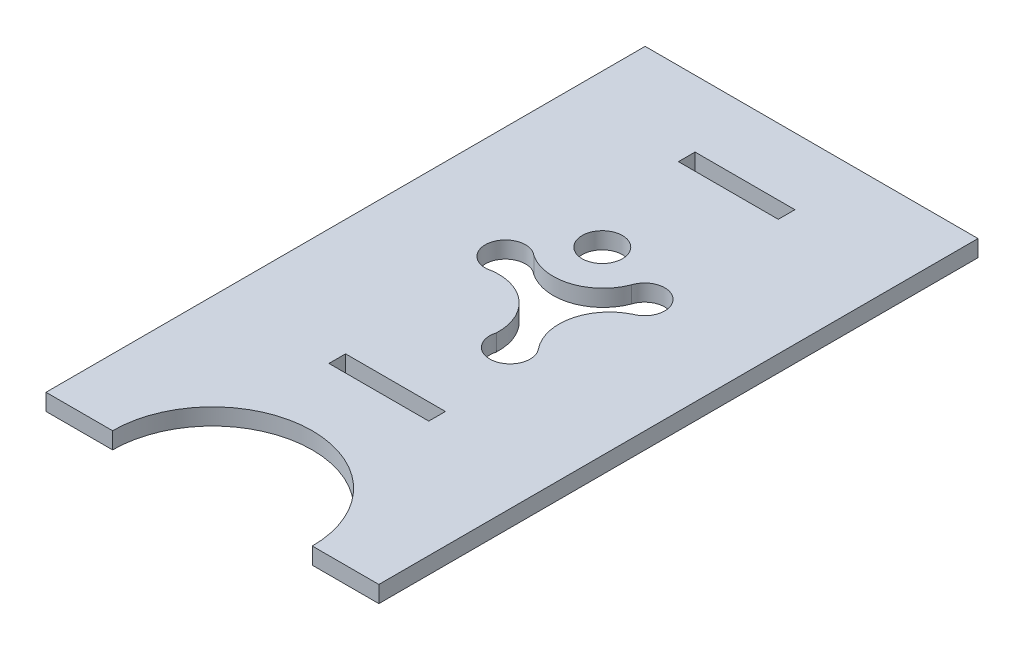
ISO-10303-21;
HEADER;
FILE_DESCRIPTION(('STEP AP214'),'2;1');
FILE_NAME('part.step','',(''),(''),'','','');
FILE_SCHEMA(('AUTOMOTIVE_DESIGN { 1 0 10303 214 1 1 1 1 }'));
ENDSEC;
DATA;
#1=APPLICATION_CONTEXT('core data for automotive mechanical design processes');
#2=APPLICATION_PROTOCOL_DEFINITION('international standard','automotive_design',2000,#1);
#3=PRODUCT_CONTEXT('',#1,'mechanical');
#4=PRODUCT('Part','Part','',(#3));
#5=PRODUCT_RELATED_PRODUCT_CATEGORY('part','',(#4));
#6=PRODUCT_DEFINITION_FORMATION('','',#4);
#7=PRODUCT_DEFINITION_CONTEXT('part definition',#1,'design');
#8=PRODUCT_DEFINITION('design','',#6,#7);
#9=PRODUCT_DEFINITION_SHAPE('','',#8);
#10=(LENGTH_UNIT() NAMED_UNIT(*) SI_UNIT(.MILLI.,.METRE.));
#11=(NAMED_UNIT(*) PLANE_ANGLE_UNIT() SI_UNIT($,.RADIAN.));
#12=(NAMED_UNIT(*) SI_UNIT($,.STERADIAN.) SOLID_ANGLE_UNIT());
#13=UNCERTAINTY_MEASURE_WITH_UNIT(LENGTH_MEASURE(1.E-05),#10,'distance_accuracy_value','');
#14=(GEOMETRIC_REPRESENTATION_CONTEXT(3) GLOBAL_UNCERTAINTY_ASSIGNED_CONTEXT((#13)) GLOBAL_UNIT_ASSIGNED_CONTEXT((#10,
#11,#12)) REPRESENTATION_CONTEXT('',''));
#15=CARTESIAN_POINT('',(0.,0.,0.));
#16=DIRECTION('',(0.,0.,1.));
#17=DIRECTION('',(1.,0.,0.));
#18=AXIS2_PLACEMENT_3D('',#15,#16,#17);
#19=CARTESIAN_POINT('',(320.516384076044,5.,0.));
#20=DIRECTION('',(-1.,0.,0.));
#21=DIRECTION('',(0.,0.,1.));
#22=AXIS2_PLACEMENT_3D('',#19,#20,#21);
#23=PLANE('',#22);
#24=DIRECTION('',(0.,0.,-1.));
#25=VECTOR('',#24,1.);
#26=CARTESIAN_POINT('',(320.516384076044,0.,0.));
#27=LINE('',#26,#25);
#28=CARTESIAN_POINT('',(320.516384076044,0.,-24.0936382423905));
#29=VERTEX_POINT('',#28);
#30=CARTESIAN_POINT('',(320.516384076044,0.,-29.0936382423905));
#31=VERTEX_POINT('',#30);
#32=EDGE_CURVE('E296',#29,#31,#27,.T.);
#33=ORIENTED_EDGE('',*,*,#32,.T.);
#34=DIRECTION('',(0.,-1.,0.));
#35=VECTOR('',#34,1.);
#36=CARTESIAN_POINT('',(320.516384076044,5.,-29.0936382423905));
#37=LINE('',#36,#35);
#38=CARTESIAN_POINT('',(320.516384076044,5.,-29.0936382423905));
#39=VERTEX_POINT('',#38);
#40=EDGE_CURVE('E11',#39,#31,#37,.T.);
#41=ORIENTED_EDGE('',*,*,#40,.F.);
#42=DIRECTION('',(0.,0.,-1.));
#43=VECTOR('',#42,1.);
#44=CARTESIAN_POINT('',(320.516384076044,5.,0.));
#45=LINE('',#44,#43);
#46=CARTESIAN_POINT('',(320.516384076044,5.,-24.0936382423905));
#47=VERTEX_POINT('',#46);
#48=EDGE_CURVE('E258',#47,#39,#45,.T.);
#49=ORIENTED_EDGE('',*,*,#48,.F.);
#50=DIRECTION('',(0.,-1.,0.));
#51=VECTOR('',#50,1.);
#52=CARTESIAN_POINT('',(320.516384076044,5.,-24.0936382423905));
#53=LINE('',#52,#51);
#54=EDGE_CURVE('E304',#47,#29,#53,.T.);
#55=ORIENTED_EDGE('',*,*,#54,.T.);
#56=EDGE_LOOP('',(#33,#41,#49,#55));
#57=FACE_BOUND('',#56,.T.);
#58=ADVANCED_FACE('F34',(#57),#23,.F.);
#59=CARTESIAN_POINT('',(0.,5.,-29.0936382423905));
#60=DIRECTION('',(0.,0.,-1.));
#61=DIRECTION('',(-1.,0.,0.));
#62=AXIS2_PLACEMENT_3D('',#59,#60,#61);
#63=PLANE('',#62);
#64=DIRECTION('',(1.,0.,0.));
#65=VECTOR('',#64,1.);
#66=CARTESIAN_POINT('',(0.,0.,-29.0936382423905));
#67=LINE('',#66,#65);
#68=CARTESIAN_POINT('',(350.516384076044,0.,-29.0936382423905));
#69=VERTEX_POINT('',#68);
#70=EDGE_CURVE('E299',#31,#69,#67,.T.);
#71=ORIENTED_EDGE('',*,*,#70,.T.);
#72=DIRECTION('',(0.,-1.,0.));
#73=VECTOR('',#72,1.);
#74=CARTESIAN_POINT('',(350.516384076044,5.,-29.0936382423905));
#75=LINE('',#74,#73);
#76=CARTESIAN_POINT('',(350.516384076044,5.,-29.0936382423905));
#77=VERTEX_POINT('',#76);
#78=EDGE_CURVE('E43',#77,#69,#75,.T.);
#79=ORIENTED_EDGE('',*,*,#78,.F.);
#80=DIRECTION('',(1.,0.,0.));
#81=VECTOR('',#80,1.);
#82=CARTESIAN_POINT('',(0.,5.,-29.0936382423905));
#83=LINE('',#82,#81);
#84=EDGE_CURVE('E261',#39,#77,#83,.T.);
#85=ORIENTED_EDGE('',*,*,#84,.F.);
#86=ORIENTED_EDGE('',*,*,#40,.T.);
#87=EDGE_LOOP('',(#71,#79,#85,#86));
#88=FACE_BOUND('',#87,.T.);
#89=ADVANCED_FACE('F363',(#88),#63,.F.);
#90=CARTESIAN_POINT('',(350.516384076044,5.,0.));
#91=DIRECTION('',(1.,0.,0.));
#92=DIRECTION('',(0.,0.,-1.));
#93=AXIS2_PLACEMENT_3D('',#90,#91,#92);
#94=PLANE('',#93);
#95=DIRECTION('',(0.,0.,1.));
#96=VECTOR('',#95,1.);
#97=CARTESIAN_POINT('',(350.516384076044,0.,0.));
#98=LINE('',#97,#96);
#99=CARTESIAN_POINT('',(350.516384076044,0.,-24.0936382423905));
#100=VERTEX_POINT('',#99);
#101=EDGE_CURVE('E301',#69,#100,#98,.T.);
#102=ORIENTED_EDGE('',*,*,#101,.T.);
#103=DIRECTION('',(0.,-1.,0.));
#104=VECTOR('',#103,1.);
#105=CARTESIAN_POINT('',(350.516384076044,5.,-24.0936382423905));
#106=LINE('',#105,#104);
#107=CARTESIAN_POINT('',(350.516384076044,5.,-24.0936382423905));
#108=VERTEX_POINT('',#107);
#109=EDGE_CURVE('E307',#108,#100,#106,.T.);
#110=ORIENTED_EDGE('',*,*,#109,.F.);
#111=DIRECTION('',(0.,0.,1.));
#112=VECTOR('',#111,1.);
#113=CARTESIAN_POINT('',(350.516384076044,5.,0.));
#114=LINE('',#113,#112);
#115=EDGE_CURVE('E263',#77,#108,#114,.T.);
#116=ORIENTED_EDGE('',*,*,#115,.F.);
#117=ORIENTED_EDGE('',*,*,#78,.T.);
#118=EDGE_LOOP('',(#102,#110,#116,#117));
#119=FACE_BOUND('',#118,.T.);
#120=ADVANCED_FACE('F369',(#119),#94,.F.);
#121=CARTESIAN_POINT('',(320.516384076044,5.,0.));
#122=DIRECTION('',(1.,0.,0.));
#123=DIRECTION('',(0.,0.,-1.));
#124=AXIS2_PLACEMENT_3D('',#121,#122,#123);
#125=PLANE('',#124);
#126=DIRECTION('',(0.,0.,1.));
#127=VECTOR('',#126,1.);
#128=CARTESIAN_POINT('',(320.516384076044,0.,0.));
#129=LINE('',#128,#127);
#130=CARTESIAN_POINT('',(320.516384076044,0.,75.9063617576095));
#131=VERTEX_POINT('',#130);
#132=CARTESIAN_POINT('',(320.516384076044,0.,80.9063617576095));
#133=VERTEX_POINT('',#132);
#134=EDGE_CURVE('E284',#131,#133,#129,.T.);
#135=ORIENTED_EDGE('',*,*,#134,.F.);
#136=DIRECTION('',(0.,-1.,0.));
#137=VECTOR('',#136,1.);
#138=CARTESIAN_POINT('',(320.516384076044,5.,75.9063617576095));
#139=LINE('',#138,#137);
#140=CARTESIAN_POINT('',(320.516384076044,5.,75.9063617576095));
#141=VERTEX_POINT('',#140);
#142=EDGE_CURVE('E308',#141,#131,#139,.T.);
#143=ORIENTED_EDGE('',*,*,#142,.F.);
#144=DIRECTION('',(0.,0.,1.));
#145=VECTOR('',#144,1.);
#146=CARTESIAN_POINT('',(320.516384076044,5.,0.));
#147=LINE('',#146,#145);
#148=CARTESIAN_POINT('',(320.516384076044,5.,80.9063617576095));
#149=VERTEX_POINT('',#148);
#150=EDGE_CURVE('E246',#141,#149,#147,.T.);
#151=ORIENTED_EDGE('',*,*,#150,.T.);
#152=DIRECTION('',(0.,-1.,0.));
#153=VECTOR('',#152,1.);
#154=CARTESIAN_POINT('',(320.516384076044,5.,80.9063617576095));
#155=LINE('',#154,#153);
#156=EDGE_CURVE('E313',#149,#133,#155,.T.);
#157=ORIENTED_EDGE('',*,*,#156,.T.);
#158=EDGE_LOOP('',(#135,#143,#151,#157));
#159=FACE_BOUND('',#158,.T.);
#160=ADVANCED_FACE('F385',(#159),#125,.T.);
#161=CARTESIAN_POINT('',(0.,5.,75.9063617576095));
#162=DIRECTION('',(0.,0.,1.));
#163=DIRECTION('',(1.,0.,0.));
#164=AXIS2_PLACEMENT_3D('',#161,#162,#163);
#165=PLANE('',#164);
#166=DIRECTION('',(-1.,0.,0.));
#167=VECTOR('',#166,1.);
#168=CARTESIAN_POINT('',(0.,0.,75.9063617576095));
#169=LINE('',#168,#167);
#170=CARTESIAN_POINT('',(350.516384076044,0.,75.9063617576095));
#171=VERTEX_POINT('',#170);
#172=EDGE_CURVE('E287',#171,#131,#169,.T.);
#173=ORIENTED_EDGE('',*,*,#172,.F.);
#174=DIRECTION('',(0.,-1.,0.));
#175=VECTOR('',#174,1.);
#176=CARTESIAN_POINT('',(350.516384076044,5.,75.9063617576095));
#177=LINE('',#176,#175);
#178=CARTESIAN_POINT('',(350.516384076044,5.,75.9063617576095));
#179=VERTEX_POINT('',#178);
#180=EDGE_CURVE('E317',#179,#171,#177,.T.);
#181=ORIENTED_EDGE('',*,*,#180,.F.);
#182=DIRECTION('',(-1.,0.,0.));
#183=VECTOR('',#182,1.);
#184=CARTESIAN_POINT('',(0.,5.,75.9063617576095));
#185=LINE('',#184,#183);
#186=EDGE_CURVE('E249',#179,#141,#185,.T.);
#187=ORIENTED_EDGE('',*,*,#186,.T.);
#188=ORIENTED_EDGE('',*,*,#142,.T.);
#189=EDGE_LOOP('',(#173,#181,#187,#188));
#190=FACE_BOUND('',#189,.T.);
#191=ADVANCED_FACE('F381',(#190),#165,.T.);
#192=CARTESIAN_POINT('',(350.516384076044,5.,0.));
#193=DIRECTION('',(-1.,0.,0.));
#194=DIRECTION('',(0.,0.,1.));
#195=AXIS2_PLACEMENT_3D('',#192,#193,#194);
#196=PLANE('',#195);
#197=DIRECTION('',(0.,0.,-1.));
#198=VECTOR('',#197,1.);
#199=CARTESIAN_POINT('',(350.516384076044,0.,0.));
#200=LINE('',#199,#198);
#201=CARTESIAN_POINT('',(350.516384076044,0.,80.9063617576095));
#202=VERTEX_POINT('',#201);
#203=EDGE_CURVE('E290',#202,#171,#200,.T.);
#204=ORIENTED_EDGE('',*,*,#203,.F.);
#205=DIRECTION('',(0.,-1.,0.));
#206=VECTOR('',#205,1.);
#207=CARTESIAN_POINT('',(350.516384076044,5.,80.9063617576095));
#208=LINE('',#207,#206);
#209=CARTESIAN_POINT('',(350.516384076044,5.,80.9063617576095));
#210=VERTEX_POINT('',#209);
#211=EDGE_CURVE('E315',#210,#202,#208,.T.);
#212=ORIENTED_EDGE('',*,*,#211,.F.);
#213=DIRECTION('',(0.,0.,-1.));
#214=VECTOR('',#213,1.);
#215=CARTESIAN_POINT('',(350.516384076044,5.,0.));
#216=LINE('',#215,#214);
#217=EDGE_CURVE('E252',#210,#179,#216,.T.);
#218=ORIENTED_EDGE('',*,*,#217,.T.);
#219=ORIENTED_EDGE('',*,*,#180,.T.);
#220=EDGE_LOOP('',(#204,#212,#218,#219));
#221=FACE_BOUND('',#220,.T.);
#222=ADVANCED_FACE('F378',(#221),#196,.T.);
#223=CARTESIAN_POINT('',(335.516384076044,5.,130.90636175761));
#224=DIRECTION('',(0.,-1.,0.));
#225=DIRECTION('',(0.,0.,-1.));
#226=AXIS2_PLACEMENT_3D('',#223,#224,#225);
#227=CYLINDRICAL_SURFACE('',#226,30.);
#228=CARTESIAN_POINT('',(335.516384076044,0.,130.90636175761));
#229=DIRECTION('',(0.,1.,0.));
#230=DIRECTION('',(0.,0.,1.));
#231=AXIS2_PLACEMENT_3D('',#228,#229,#230);
#232=CIRCLE('',#231,30.);
#233=CARTESIAN_POINT('',(365.516384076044,0.,130.90636175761));
#234=VERTEX_POINT('',#233);
#235=CARTESIAN_POINT('',(305.516384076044,0.,130.90636175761));
#236=VERTEX_POINT('',#235);
#237=EDGE_CURVE('E222',#234,#236,#232,.T.);
#238=ORIENTED_EDGE('',*,*,#237,.F.);
#239=DIRECTION('',(0.,-1.,0.));
#240=VECTOR('',#239,1.);
#241=CARTESIAN_POINT('',(365.516384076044,5.,130.90636175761));
#242=LINE('',#241,#240);
#243=CARTESIAN_POINT('',(365.516384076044,5.,130.90636175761));
#244=VERTEX_POINT('',#243);
#245=EDGE_CURVE('E38',#244,#234,#242,.T.);
#246=ORIENTED_EDGE('',*,*,#245,.F.);
#247=CARTESIAN_POINT('',(335.516384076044,5.,130.90636175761));
#248=DIRECTION('',(0.,1.,0.));
#249=DIRECTION('',(0.,0.,1.));
#250=AXIS2_PLACEMENT_3D('',#247,#248,#249);
#251=CIRCLE('',#250,30.);
#252=CARTESIAN_POINT('',(305.516384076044,5.,130.90636175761));
#253=VERTEX_POINT('',#252);
#254=EDGE_CURVE('E230',#244,#253,#251,.T.);
#255=ORIENTED_EDGE('',*,*,#254,.T.);
#256=DIRECTION('',(0.,-1.,0.));
#257=VECTOR('',#256,1.);
#258=CARTESIAN_POINT('',(305.516384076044,5.,130.90636175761));
#259=LINE('',#258,#257);
#260=EDGE_CURVE('E267',#253,#236,#259,.T.);
#261=ORIENTED_EDGE('',*,*,#260,.T.);
#262=EDGE_LOOP('',(#238,#246,#255,#261));
#263=FACE_BOUND('',#262,.T.);
#264=ADVANCED_FACE('F36',(#263),#227,.F.);
#265=CARTESIAN_POINT('',(0.,5.,130.90636175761));
#266=DIRECTION('',(0.,0.,-1.));
#267=DIRECTION('',(-1.,0.,0.));
#268=AXIS2_PLACEMENT_3D('',#265,#266,#267);
#269=PLANE('',#268);
#270=DIRECTION('',(1.,0.,0.));
#271=VECTOR('',#270,1.);
#272=CARTESIAN_POINT('',(0.,0.,130.90636175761));
#273=LINE('',#272,#271);
#274=CARTESIAN_POINT('',(385.516384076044,0.,130.90636175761));
#275=VERTEX_POINT('',#274);
#276=EDGE_CURVE('E270',#234,#275,#273,.T.);
#277=ORIENTED_EDGE('',*,*,#276,.T.);
#278=DIRECTION('',(0.,-1.,0.));
#279=VECTOR('',#278,1.);
#280=CARTESIAN_POINT('',(385.516384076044,5.,130.90636175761));
#281=LINE('',#280,#279);
#282=CARTESIAN_POINT('',(385.516384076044,5.,130.90636175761));
#283=VERTEX_POINT('',#282);
#284=EDGE_CURVE('E326',#283,#275,#281,.T.);
#285=ORIENTED_EDGE('',*,*,#284,.F.);
#286=DIRECTION('',(1.,0.,0.));
#287=VECTOR('',#286,1.);
#288=CARTESIAN_POINT('',(0.,5.,130.90636175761));
#289=LINE('',#288,#287);
#290=EDGE_CURVE('E233',#244,#283,#289,.T.);
#291=ORIENTED_EDGE('',*,*,#290,.F.);
#292=ORIENTED_EDGE('',*,*,#245,.T.);
#293=EDGE_LOOP('',(#277,#285,#291,#292));
#294=FACE_BOUND('',#293,.T.);
#295=ADVANCED_FACE('F335',(#294),#269,.F.);
#296=CARTESIAN_POINT('',(385.516384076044,5.,0.));
#297=DIRECTION('',(-1.,0.,0.));
#298=DIRECTION('',(0.,0.,1.));
#299=AXIS2_PLACEMENT_3D('',#296,#297,#298);
#300=PLANE('',#299);
#301=DIRECTION('',(0.,0.,-1.));
#302=VECTOR('',#301,1.);
#303=CARTESIAN_POINT('',(385.516384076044,0.,0.));
#304=LINE('',#303,#302);
#305=CARTESIAN_POINT('',(385.516384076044,0.,-49.0936382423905));
#306=VERTEX_POINT('',#305);
#307=EDGE_CURVE('E272',#275,#306,#304,.T.);
#308=ORIENTED_EDGE('',*,*,#307,.T.);
#309=DIRECTION('',(0.,-1.,0.));
#310=VECTOR('',#309,1.);
#311=CARTESIAN_POINT('',(385.516384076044,5.,-49.0936382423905));
#312=LINE('',#311,#310);
#313=CARTESIAN_POINT('',(385.516384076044,5.,-49.0936382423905));
#314=VERTEX_POINT('',#313);
#315=EDGE_CURVE('E325',#314,#306,#312,.T.);
#316=ORIENTED_EDGE('',*,*,#315,.F.);
#317=DIRECTION('',(0.,0.,-1.));
#318=VECTOR('',#317,1.);
#319=CARTESIAN_POINT('',(385.516384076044,5.,0.));
#320=LINE('',#319,#318);
#321=EDGE_CURVE('E236',#283,#314,#320,.T.);
#322=ORIENTED_EDGE('',*,*,#321,.F.);
#323=ORIENTED_EDGE('',*,*,#284,.T.);
#324=EDGE_LOOP('',(#308,#316,#322,#323));
#325=FACE_BOUND('',#324,.T.);
#326=ADVANCED_FACE('F354',(#325),#300,.F.);
#327=CARTESIAN_POINT('',(0.,5.,-49.0936382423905));
#328=DIRECTION('',(0.,0.,-1.));
#329=DIRECTION('',(-1.,0.,0.));
#330=AXIS2_PLACEMENT_3D('',#327,#328,#329);
#331=PLANE('',#330);
#332=DIRECTION('',(1.,0.,0.));
#333=VECTOR('',#332,1.);
#334=CARTESIAN_POINT('',(0.,0.,-49.0936382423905));
#335=LINE('',#334,#333);
#336=CARTESIAN_POINT('',(285.516384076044,0.,-49.0936382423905));
#337=VERTEX_POINT('',#336);
#338=EDGE_CURVE('E275',#337,#306,#335,.T.);
#339=ORIENTED_EDGE('',*,*,#338,.F.);
#340=DIRECTION('',(0.,-1.,0.));
#341=VECTOR('',#340,1.);
#342=CARTESIAN_POINT('',(285.516384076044,5.,-49.0936382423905));
#343=LINE('',#342,#341);
#344=CARTESIAN_POINT('',(285.516384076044,5.,-49.0936382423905));
#345=VERTEX_POINT('',#344);
#346=EDGE_CURVE('E323',#345,#337,#343,.T.);
#347=ORIENTED_EDGE('',*,*,#346,.F.);
#348=DIRECTION('',(1.,0.,0.));
#349=VECTOR('',#348,1.);
#350=CARTESIAN_POINT('',(0.,5.,-49.0936382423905));
#351=LINE('',#350,#349);
#352=EDGE_CURVE('E238',#345,#314,#351,.T.);
#353=ORIENTED_EDGE('',*,*,#352,.T.);
#354=ORIENTED_EDGE('',*,*,#315,.T.);
#355=EDGE_LOOP('',(#339,#347,#353,#354));
#356=FACE_BOUND('',#355,.T.);
#357=ADVANCED_FACE('F352',(#356),#331,.T.);
#358=CARTESIAN_POINT('',(285.516384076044,5.,0.));
#359=DIRECTION('',(-1.,0.,0.));
#360=DIRECTION('',(0.,0.,1.));
#361=AXIS2_PLACEMENT_3D('',#358,#359,#360);
#362=PLANE('',#361);
#363=DIRECTION('',(0.,0.,-1.));
#364=VECTOR('',#363,1.);
#365=CARTESIAN_POINT('',(285.516384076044,0.,0.));
#366=LINE('',#365,#364);
#367=CARTESIAN_POINT('',(285.516384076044,0.,130.90636175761));
#368=VERTEX_POINT('',#367);
#369=EDGE_CURVE('E278',#368,#337,#366,.T.);
#370=ORIENTED_EDGE('',*,*,#369,.F.);
#371=DIRECTION('',(0.,-1.,0.));
#372=VECTOR('',#371,1.);
#373=CARTESIAN_POINT('',(285.516384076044,5.,130.90636175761));
#374=LINE('',#373,#372);
#375=CARTESIAN_POINT('',(285.516384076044,5.,130.90636175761));
#376=VERTEX_POINT('',#375);
#377=EDGE_CURVE('E321',#376,#368,#374,.T.);
#378=ORIENTED_EDGE('',*,*,#377,.F.);
#379=DIRECTION('',(0.,0.,-1.));
#380=VECTOR('',#379,1.);
#381=CARTESIAN_POINT('',(285.516384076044,5.,0.));
#382=LINE('',#381,#380);
#383=EDGE_CURVE('E241',#376,#345,#382,.T.);
#384=ORIENTED_EDGE('',*,*,#383,.T.);
#385=ORIENTED_EDGE('',*,*,#346,.T.);
#386=EDGE_LOOP('',(#370,#378,#384,#385));
#387=FACE_BOUND('',#386,.T.);
#388=ADVANCED_FACE('F347',(#387),#362,.T.);
#389=CARTESIAN_POINT('',(0.,5.,80.9063617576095));
#390=DIRECTION('',(0.,0.,-1.));
#391=DIRECTION('',(-1.,0.,0.));
#392=AXIS2_PLACEMENT_3D('',#389,#390,#391);
#393=PLANE('',#392);
#394=DIRECTION('',(1.,0.,0.));
#395=VECTOR('',#394,1.);
#396=CARTESIAN_POINT('',(0.,0.,80.9063617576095));
#397=LINE('',#396,#395);
#398=EDGE_CURVE('E293',#133,#202,#397,.T.);
#399=ORIENTED_EDGE('',*,*,#398,.F.);
#400=ORIENTED_EDGE('',*,*,#156,.F.);
#401=DIRECTION('',(1.,0.,0.));
#402=VECTOR('',#401,1.);
#403=CARTESIAN_POINT('',(0.,5.,80.9063617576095));
#404=LINE('',#403,#402);
#405=EDGE_CURVE('E255',#149,#210,#404,.T.);
#406=ORIENTED_EDGE('',*,*,#405,.T.);
#407=ORIENTED_EDGE('',*,*,#211,.T.);
#408=EDGE_LOOP('',(#399,#400,#406,#407));
#409=FACE_BOUND('',#408,.T.);
#410=ADVANCED_FACE('F374',(#409),#393,.T.);
#411=CARTESIAN_POINT('',(0.,5.,130.90636175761));
#412=DIRECTION('',(0.,0.,-1.));
#413=DIRECTION('',(-1.,0.,0.));
#414=AXIS2_PLACEMENT_3D('',#411,#412,#413);
#415=PLANE('',#414);
#416=DIRECTION('',(1.,0.,0.));
#417=VECTOR('',#416,1.);
#418=CARTESIAN_POINT('',(0.,0.,130.90636175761));
#419=LINE('',#418,#417);
#420=EDGE_CURVE('E281',#368,#236,#419,.T.);
#421=ORIENTED_EDGE('',*,*,#420,.T.);
#422=ORIENTED_EDGE('',*,*,#260,.F.);
#423=DIRECTION('',(1.,0.,0.));
#424=VECTOR('',#423,1.);
#425=CARTESIAN_POINT('',(0.,5.,130.90636175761));
#426=LINE('',#425,#424);
#427=EDGE_CURVE('E244',#376,#253,#426,.T.);
#428=ORIENTED_EDGE('',*,*,#427,.F.);
#429=ORIENTED_EDGE('',*,*,#377,.T.);
#430=EDGE_LOOP('',(#421,#422,#428,#429));
#431=FACE_BOUND('',#430,.T.);
#432=ADVANCED_FACE('F344',(#431),#415,.F.);
#433=CARTESIAN_POINT('',(0.,5.,-24.0936382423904));
#434=DIRECTION('',(0.,0.,1.));
#435=DIRECTION('',(1.,0.,0.));
#436=AXIS2_PLACEMENT_3D('',#433,#434,#435);
#437=PLANE('',#436);
#438=DIRECTION('',(-1.,0.,0.));
#439=VECTOR('',#438,1.);
#440=CARTESIAN_POINT('',(0.,0.,-24.0936382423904));
#441=LINE('',#440,#439);
#442=EDGE_CURVE('E234',#100,#29,#441,.T.);
#443=ORIENTED_EDGE('',*,*,#442,.T.);
#444=ORIENTED_EDGE('',*,*,#54,.F.);
#445=DIRECTION('',(-1.,0.,0.));
#446=VECTOR('',#445,1.);
#447=CARTESIAN_POINT('',(0.,5.,-24.0936382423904));
#448=LINE('',#447,#446);
#449=EDGE_CURVE('E265',#108,#47,#448,.T.);
#450=ORIENTED_EDGE('',*,*,#449,.F.);
#451=ORIENTED_EDGE('',*,*,#109,.T.);
#452=EDGE_LOOP('',(#443,#444,#450,#451));
#453=FACE_BOUND('',#452,.T.);
#454=ADVANCED_FACE('F392',(#453),#437,.F.);
#455=CARTESIAN_POINT('',(0.,5.,0.));
#456=DIRECTION('',(0.,1.,0.));
#457=DIRECTION('',(0.,0.,1.));
#458=AXIS2_PLACEMENT_3D('',#455,#456,#457);
#459=PLANE('',#458);
#460=CARTESIAN_POINT('',(331.312352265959,5.,9.57710534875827));
#461=DIRECTION('',(0.,1.,0.));
#462=DIRECTION('',(0.,0.,1.));
#463=AXIS2_PLACEMENT_3D('',#460,#461,#462);
#464=CIRCLE('',#463,6.05062381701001);
#465=CARTESIAN_POINT('',(331.312352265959,5.,15.6277291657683));
#466=VERTEX_POINT('',#465);
#467=EDGE_CURVE('E198',#466,#466,#464,.T.);
#468=ORIENTED_EDGE('',*,*,#467,.F.);
#469=EDGE_LOOP('',(#468));
#470=FACE_BOUND('',#469,.T.);
#471=CARTESIAN_POINT('',(359.997267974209,5.,36.1050249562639));
#472=DIRECTION('',(0.,-1.,0.));
#473=DIRECTION('',(0.,0.,1.));
#474=AXIS2_PLACEMENT_3D('',#471,#472,#473);
#475=CIRCLE('',#474,15.1697355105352);
#476=CARTESIAN_POINT('',(348.187897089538,5.,45.6265602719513));
#477=VERTEX_POINT('',#476);
#478=CARTESIAN_POINT('',(353.340812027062,5.,22.4737201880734));
#479=VERTEX_POINT('',#478);
#480=EDGE_CURVE('E51',#477,#479,#475,.T.);
#481=ORIENTED_EDGE('',*,*,#480,.F.);
#482=CARTESIAN_POINT('',(343.533575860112,5.,49.5317243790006));
#483=DIRECTION('',(0.,1.,0.));
#484=DIRECTION('',(0.,0.,1.));
#485=AXIS2_PLACEMENT_3D('',#482,#483,#484);
#486=CIRCLE('',#485,6.07560801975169);
#487=CARTESIAN_POINT('',(337.704600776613,5.,47.8182302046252));
#488=VERTEX_POINT('',#487);
#489=EDGE_CURVE('E192',#488,#477,#486,.T.);
#490=ORIENTED_EDGE('',*,*,#489,.F.);
#491=CARTESIAN_POINT('',(322.786208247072,5.,47.1331914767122));
#492=DIRECTION('',(0.,-1.,0.));
#493=DIRECTION('',(0.,0.,-1.));
#494=AXIS2_PLACEMENT_3D('',#491,#492,#493);
#495=CIRCLE('',#494,14.9341124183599);
#496=CARTESIAN_POINT('',(320.977861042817,5.,32.3089682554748));
#497=VERTEX_POINT('',#496);
#498=EDGE_CURVE('E195',#497,#488,#495,.T.);
#499=ORIENTED_EDGE('',*,*,#498,.F.);
#500=CARTESIAN_POINT('',(319.163390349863,5.,26.5394534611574));
#501=DIRECTION('',(0.,1.,0.));
#502=DIRECTION('',(0.,0.,1.));
#503=AXIS2_PLACEMENT_3D('',#500,#501,#502);
#504=CIRCLE('',#503,6.04810754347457);
#505=CARTESIAN_POINT('',(323.150194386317,5.,21.991377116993));
#506=VERTEX_POINT('',#505);
#507=EDGE_CURVE('E215',#506,#497,#504,.T.);
#508=ORIENTED_EDGE('',*,*,#507,.F.);
#509=CARTESIAN_POINT('',(331.540936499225,5.,9.57890404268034));
#510=DIRECTION('',(0.,-1.,0.));
#511=DIRECTION('',(0.,0.,1.));
#512=AXIS2_PLACEMENT_3D('',#509,#510,#511);
#513=CIRCLE('',#512,14.9824577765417);
#514=CARTESIAN_POINT('',(345.492976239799,5.,15.0391813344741));
#515=VERTEX_POINT('',#514);
#516=EDGE_CURVE('E212',#515,#506,#513,.T.);
#517=ORIENTED_EDGE('',*,*,#516,.F.);
#518=CARTESIAN_POINT('',(351.263265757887,5.,16.8074366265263));
#519=DIRECTION('',(0.,1.,0.));
#520=DIRECTION('',(0.,0.,1.));
#521=AXIS2_PLACEMENT_3D('',#518,#519,#520);
#522=CIRCLE('',#521,6.0351443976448);
#523=EDGE_CURVE('E209',#479,#515,#522,.T.);
#524=ORIENTED_EDGE('',*,*,#523,.F.);
#525=EDGE_LOOP('',(#481,#490,#499,#508,#517,#524));
#526=FACE_BOUND('',#525,.T.);
#527=ORIENTED_EDGE('',*,*,#254,.F.);
#528=ORIENTED_EDGE('',*,*,#290,.T.);
#529=ORIENTED_EDGE('',*,*,#321,.T.);
#530=ORIENTED_EDGE('',*,*,#352,.F.);
#531=ORIENTED_EDGE('',*,*,#383,.F.);
#532=ORIENTED_EDGE('',*,*,#427,.T.);
#533=EDGE_LOOP('',(#527,#528,#529,#530,#531,#532));
#534=FACE_BOUND('',#533,.T.);
#535=ORIENTED_EDGE('',*,*,#150,.F.);
#536=ORIENTED_EDGE('',*,*,#186,.F.);
#537=ORIENTED_EDGE('',*,*,#217,.F.);
#538=ORIENTED_EDGE('',*,*,#405,.F.);
#539=EDGE_LOOP('',(#535,#536,#537,#538));
#540=FACE_BOUND('',#539,.T.);
#541=ORIENTED_EDGE('',*,*,#48,.T.);
#542=ORIENTED_EDGE('',*,*,#84,.T.);
#543=ORIENTED_EDGE('',*,*,#115,.T.);
#544=ORIENTED_EDGE('',*,*,#449,.T.);
#545=EDGE_LOOP('',(#541,#542,#543,#544));
#546=FACE_BOUND('',#545,.T.);
#547=ADVANCED_FACE('F412',(#470,#526,#534,#540,#546),#459,.T.);
#548=CARTESIAN_POINT('',(0.,0.,0.));
#549=DIRECTION('',(0.,1.,0.));
#550=DIRECTION('',(0.,0.,1.));
#551=AXIS2_PLACEMENT_3D('',#548,#549,#550);
#552=PLANE('',#551);
#553=CARTESIAN_POINT('',(331.312352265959,0.,9.57710534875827));
#554=DIRECTION('',(0.,1.,0.));
#555=DIRECTION('',(0.,0.,1.));
#556=AXIS2_PLACEMENT_3D('',#553,#554,#555);
#557=CIRCLE('',#556,6.05062381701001);
#558=CARTESIAN_POINT('',(331.312352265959,0.,15.6277291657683));
#559=VERTEX_POINT('',#558);
#560=EDGE_CURVE('E210',#559,#559,#557,.T.);
#561=ORIENTED_EDGE('',*,*,#560,.T.);
#562=EDGE_LOOP('',(#561));
#563=FACE_BOUND('',#562,.T.);
#564=CARTESIAN_POINT('',(343.533575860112,0.,49.5317243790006));
#565=DIRECTION('',(0.,1.,0.));
#566=DIRECTION('',(0.,0.,1.));
#567=AXIS2_PLACEMENT_3D('',#564,#565,#566);
#568=CIRCLE('',#567,6.07560801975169);
#569=CARTESIAN_POINT('',(337.704600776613,0.,47.8182302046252));
#570=VERTEX_POINT('',#569);
#571=CARTESIAN_POINT('',(348.187897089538,0.,45.6265602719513));
#572=VERTEX_POINT('',#571);
#573=EDGE_CURVE('E181',#570,#572,#568,.T.);
#574=ORIENTED_EDGE('',*,*,#573,.T.);
#575=CARTESIAN_POINT('',(359.997267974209,0.,36.1050249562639));
#576=DIRECTION('',(0.,-1.,0.));
#577=DIRECTION('',(0.,0.,1.));
#578=AXIS2_PLACEMENT_3D('',#575,#576,#577);
#579=CIRCLE('',#578,15.1697355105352);
#580=CARTESIAN_POINT('',(353.340812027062,0.,22.4737201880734));
#581=VERTEX_POINT('',#580);
#582=EDGE_CURVE('E175',#572,#581,#579,.T.);
#583=ORIENTED_EDGE('',*,*,#582,.T.);
#584=CARTESIAN_POINT('',(351.263265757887,0.,16.8074366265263));
#585=DIRECTION('',(0.,1.,0.));
#586=DIRECTION('',(0.,0.,1.));
#587=AXIS2_PLACEMENT_3D('',#584,#585,#586);
#588=CIRCLE('',#587,6.0351443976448);
#589=CARTESIAN_POINT('',(345.492976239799,0.,15.039181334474));
#590=VERTEX_POINT('',#589);
#591=EDGE_CURVE('E184',#581,#590,#588,.T.);
#592=ORIENTED_EDGE('',*,*,#591,.T.);
#593=CARTESIAN_POINT('',(331.540936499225,0.,9.57890404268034));
#594=DIRECTION('',(0.,-1.,0.));
#595=DIRECTION('',(0.,0.,1.));
#596=AXIS2_PLACEMENT_3D('',#593,#594,#595);
#597=CIRCLE('',#596,14.9824577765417);
#598=CARTESIAN_POINT('',(323.150194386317,0.,21.991377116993));
#599=VERTEX_POINT('',#598);
#600=EDGE_CURVE('E59',#590,#599,#597,.T.);
#601=ORIENTED_EDGE('',*,*,#600,.T.);
#602=CARTESIAN_POINT('',(319.163390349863,0.,26.5394534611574));
#603=DIRECTION('',(0.,1.,0.));
#604=DIRECTION('',(0.,0.,1.));
#605=AXIS2_PLACEMENT_3D('',#602,#603,#604);
#606=CIRCLE('',#605,6.04810754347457);
#607=CARTESIAN_POINT('',(320.977861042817,0.,32.3089682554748));
#608=VERTEX_POINT('',#607);
#609=EDGE_CURVE('E202',#599,#608,#606,.T.);
#610=ORIENTED_EDGE('',*,*,#609,.T.);
#611=CARTESIAN_POINT('',(322.786208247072,0.,47.1331914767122));
#612=DIRECTION('',(0.,-1.,0.));
#613=DIRECTION('',(0.,0.,-1.));
#614=AXIS2_PLACEMENT_3D('',#611,#612,#613);
#615=CIRCLE('',#614,14.9341124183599);
#616=EDGE_CURVE('E205',#608,#570,#615,.T.);
#617=ORIENTED_EDGE('',*,*,#616,.T.);
#618=EDGE_LOOP('',(#574,#583,#592,#601,#610,#617));
#619=FACE_BOUND('',#618,.T.);
#620=ORIENTED_EDGE('',*,*,#237,.T.);
#621=ORIENTED_EDGE('',*,*,#420,.F.);
#622=ORIENTED_EDGE('',*,*,#369,.T.);
#623=ORIENTED_EDGE('',*,*,#338,.T.);
#624=ORIENTED_EDGE('',*,*,#307,.F.);
#625=ORIENTED_EDGE('',*,*,#276,.F.);
#626=EDGE_LOOP('',(#620,#621,#622,#623,#624,#625));
#627=FACE_BOUND('',#626,.T.);
#628=ORIENTED_EDGE('',*,*,#134,.T.);
#629=ORIENTED_EDGE('',*,*,#398,.T.);
#630=ORIENTED_EDGE('',*,*,#203,.T.);
#631=ORIENTED_EDGE('',*,*,#172,.T.);
#632=EDGE_LOOP('',(#628,#629,#630,#631));
#633=FACE_BOUND('',#632,.T.);
#634=ORIENTED_EDGE('',*,*,#32,.F.);
#635=ORIENTED_EDGE('',*,*,#442,.F.);
#636=ORIENTED_EDGE('',*,*,#101,.F.);
#637=ORIENTED_EDGE('',*,*,#70,.F.);
#638=EDGE_LOOP('',(#634,#635,#636,#637));
#639=FACE_BOUND('',#638,.T.);
#640=ADVANCED_FACE('F188',(#563,#619,#627,#633,#639),#552,.F.);
#641=CARTESIAN_POINT('',(359.997267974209,0.,36.1050249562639));
#642=DIRECTION('',(0.,1.,0.));
#643=DIRECTION('',(0.,0.,1.));
#644=AXIS2_PLACEMENT_3D('',#641,#642,#643);
#645=CYLINDRICAL_SURFACE('',#644,15.1697355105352);
#646=ORIENTED_EDGE('',*,*,#480,.T.);
#647=DIRECTION('',(0.,1.,0.));
#648=VECTOR('',#647,1.);
#649=CARTESIAN_POINT('',(353.340812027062,0.,22.4737201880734));
#650=LINE('',#649,#648);
#651=EDGE_CURVE('E171',#581,#479,#650,.T.);
#652=ORIENTED_EDGE('',*,*,#651,.F.);
#653=ORIENTED_EDGE('',*,*,#582,.F.);
#654=DIRECTION('',(0.,1.,0.));
#655=VECTOR('',#654,1.);
#656=CARTESIAN_POINT('',(348.187897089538,0.,45.6265602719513));
#657=LINE('',#656,#655);
#658=EDGE_CURVE('E220',#572,#477,#657,.T.);
#659=ORIENTED_EDGE('',*,*,#658,.T.);
#660=EDGE_LOOP('',(#646,#652,#653,#659));
#661=FACE_BOUND('',#660,.T.);
#662=ADVANCED_FACE('F173',(#661),#645,.T.);
#663=CARTESIAN_POINT('',(343.533575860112,0.,49.5317243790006));
#664=DIRECTION('',(0.,1.,0.));
#665=DIRECTION('',(0.,0.,1.));
#666=AXIS2_PLACEMENT_3D('',#663,#664,#665);
#667=CYLINDRICAL_SURFACE('',#666,6.07560801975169);
#668=ORIENTED_EDGE('',*,*,#489,.T.);
#669=ORIENTED_EDGE('',*,*,#658,.F.);
#670=ORIENTED_EDGE('',*,*,#573,.F.);
#671=DIRECTION('',(0.,1.,0.));
#672=VECTOR('',#671,1.);
#673=CARTESIAN_POINT('',(337.704600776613,0.,47.8182302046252));
#674=LINE('',#673,#672);
#675=EDGE_CURVE('E223',#570,#488,#674,.T.);
#676=ORIENTED_EDGE('',*,*,#675,.T.);
#677=EDGE_LOOP('',(#668,#669,#670,#676));
#678=FACE_BOUND('',#677,.T.);
#679=ADVANCED_FACE('F434',(#678),#667,.F.);
#680=CARTESIAN_POINT('',(322.786208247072,0.,47.1331914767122));
#681=DIRECTION('',(0.,1.,0.));
#682=DIRECTION('',(0.,0.,1.));
#683=AXIS2_PLACEMENT_3D('',#680,#681,#682);
#684=CYLINDRICAL_SURFACE('',#683,14.9341124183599);
#685=ORIENTED_EDGE('',*,*,#498,.T.);
#686=ORIENTED_EDGE('',*,*,#675,.F.);
#687=ORIENTED_EDGE('',*,*,#616,.F.);
#688=DIRECTION('',(0.,1.,0.));
#689=VECTOR('',#688,1.);
#690=CARTESIAN_POINT('',(320.977861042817,0.,32.3089682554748));
#691=LINE('',#690,#689);
#692=EDGE_CURVE('E225',#608,#497,#691,.T.);
#693=ORIENTED_EDGE('',*,*,#692,.T.);
#694=EDGE_LOOP('',(#685,#686,#687,#693));
#695=FACE_BOUND('',#694,.T.);
#696=ADVANCED_FACE('F441',(#695),#684,.T.);
#697=CARTESIAN_POINT('',(319.163390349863,0.,26.5394534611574));
#698=DIRECTION('',(0.,1.,0.));
#699=DIRECTION('',(0.,0.,1.));
#700=AXIS2_PLACEMENT_3D('',#697,#698,#699);
#701=CYLINDRICAL_SURFACE('',#700,6.04810754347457);
#702=ORIENTED_EDGE('',*,*,#507,.T.);
#703=ORIENTED_EDGE('',*,*,#692,.F.);
#704=ORIENTED_EDGE('',*,*,#609,.F.);
#705=DIRECTION('',(0.,1.,0.));
#706=VECTOR('',#705,1.);
#707=CARTESIAN_POINT('',(323.150194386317,0.,21.991377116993));
#708=LINE('',#707,#706);
#709=EDGE_CURVE('E227',#599,#506,#708,.T.);
#710=ORIENTED_EDGE('',*,*,#709,.T.);
#711=EDGE_LOOP('',(#702,#703,#704,#710));
#712=FACE_BOUND('',#711,.T.);
#713=ADVANCED_FACE('F449',(#712),#701,.F.);
#714=CARTESIAN_POINT('',(331.540936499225,0.,9.57890404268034));
#715=DIRECTION('',(0.,1.,0.));
#716=DIRECTION('',(0.,0.,1.));
#717=AXIS2_PLACEMENT_3D('',#714,#715,#716);
#718=CYLINDRICAL_SURFACE('',#717,14.9824577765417);
#719=ORIENTED_EDGE('',*,*,#516,.T.);
#720=ORIENTED_EDGE('',*,*,#709,.F.);
#721=ORIENTED_EDGE('',*,*,#600,.F.);
#722=DIRECTION('',(0.,1.,0.));
#723=VECTOR('',#722,1.);
#724=CARTESIAN_POINT('',(345.492976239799,0.,15.0391813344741));
#725=LINE('',#724,#723);
#726=EDGE_CURVE('E180',#590,#515,#725,.T.);
#727=ORIENTED_EDGE('',*,*,#726,.T.);
#728=EDGE_LOOP('',(#719,#720,#721,#727));
#729=FACE_BOUND('',#728,.T.);
#730=ADVANCED_FACE('F457',(#729),#718,.T.);
#731=CARTESIAN_POINT('',(351.263265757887,0.,16.8074366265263));
#732=DIRECTION('',(0.,1.,0.));
#733=DIRECTION('',(0.,0.,1.));
#734=AXIS2_PLACEMENT_3D('',#731,#732,#733);
#735=CYLINDRICAL_SURFACE('',#734,6.0351443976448);
#736=ORIENTED_EDGE('',*,*,#523,.T.);
#737=ORIENTED_EDGE('',*,*,#726,.F.);
#738=ORIENTED_EDGE('',*,*,#591,.F.);
#739=ORIENTED_EDGE('',*,*,#651,.T.);
#740=EDGE_LOOP('',(#736,#737,#738,#739));
#741=FACE_BOUND('',#740,.T.);
#742=ADVANCED_FACE('F185',(#741),#735,.F.);
#743=CARTESIAN_POINT('',(331.312352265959,0.,9.57710534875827));
#744=DIRECTION('',(0.,1.,0.));
#745=DIRECTION('',(0.,0.,1.));
#746=AXIS2_PLACEMENT_3D('',#743,#744,#745);
#747=CYLINDRICAL_SURFACE('',#746,6.05062381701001);
#748=ORIENTED_EDGE('',*,*,#560,.F.);
#749=EDGE_LOOP('',(#748));
#750=FACE_BOUND('',#749,.T.);
#751=ORIENTED_EDGE('',*,*,#467,.T.);
#752=EDGE_LOOP('',(#751));
#753=FACE_BOUND('',#752,.T.);
#754=ADVANCED_FACE('F471',(#750,#753),#747,.F.);
#755=CLOSED_SHELL('',(#58,#89,#120,#160,#191,#222,#264,#295,#326,#357,#388,#410,#432,#454,#547,
#640,#662,#679,#696,#713,#730,#742,#754));
#756=MANIFOLD_SOLID_BREP('B2',#755);
#757=ADVANCED_BREP_SHAPE_REPRESENTATION('',(#18,#756),#14);
#758=SHAPE_DEFINITION_REPRESENTATION(#9,#757);
ENDSEC;
END-ISO-10303-21;
